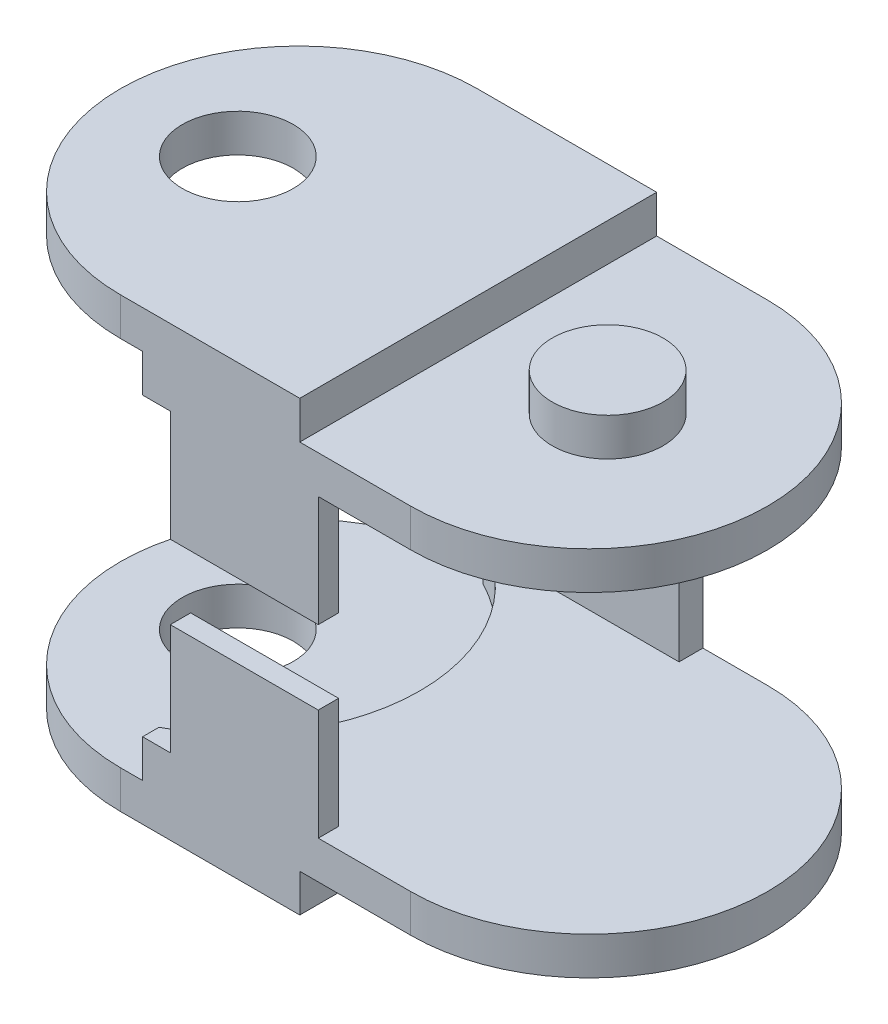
ISO-10303-21;
HEADER;
FILE_DESCRIPTION(('STEP AP214'),'2;1');
FILE_NAME('part.step','',(''),(''),'','','');
FILE_SCHEMA(('AUTOMOTIVE_DESIGN { 1 0 10303 214 1 1 1 1 }'));
ENDSEC;
DATA;
#1=APPLICATION_CONTEXT('core data for automotive mechanical design processes');
#2=APPLICATION_PROTOCOL_DEFINITION('international standard','automotive_design',2000,#1);
#3=PRODUCT_CONTEXT('',#1,'mechanical');
#4=PRODUCT('Part','Part','',(#3));
#5=PRODUCT_RELATED_PRODUCT_CATEGORY('part','',(#4));
#6=PRODUCT_DEFINITION_FORMATION('','',#4);
#7=PRODUCT_DEFINITION_CONTEXT('part definition',#1,'design');
#8=PRODUCT_DEFINITION('design','',#6,#7);
#9=PRODUCT_DEFINITION_SHAPE('','',#8);
#10=(LENGTH_UNIT() NAMED_UNIT(*) SI_UNIT(.MILLI.,.METRE.));
#11=(NAMED_UNIT(*) PLANE_ANGLE_UNIT() SI_UNIT($,.RADIAN.));
#12=(NAMED_UNIT(*) SI_UNIT($,.STERADIAN.) SOLID_ANGLE_UNIT());
#13=UNCERTAINTY_MEASURE_WITH_UNIT(LENGTH_MEASURE(1.E-05),#10,'distance_accuracy_value','');
#14=(GEOMETRIC_REPRESENTATION_CONTEXT(3) GLOBAL_UNCERTAINTY_ASSIGNED_CONTEXT((#13)) GLOBAL_UNIT_ASSIGNED_CONTEXT((#10,
#11,#12)) REPRESENTATION_CONTEXT('',''));
#15=CARTESIAN_POINT('',(0.,0.,0.));
#16=DIRECTION('',(0.,0.,1.));
#17=DIRECTION('',(1.,0.,0.));
#18=AXIS2_PLACEMENT_3D('',#15,#16,#17);
#19=CARTESIAN_POINT('',(-503.000001,20.1,56.));
#20=DIRECTION('',(0.,1.,0.));
#21=DIRECTION('',(0.,0.,1.));
#22=AXIS2_PLACEMENT_3D('',#19,#20,#21);
#23=PLANE('',#22);
#24=CARTESIAN_POINT('',(-503.000001,20.1,56.));
#25=DIRECTION('',(0.,-1.,0.));
#26=DIRECTION('',(0.,0.,-1.));
#27=AXIS2_PLACEMENT_3D('',#24,#25,#26);
#28=CIRCLE('',#27,3.);
#29=CARTESIAN_POINT('',(-503.000001,20.1,53.));
#30=VERTEX_POINT('',#29);
#31=EDGE_CURVE('E381',#30,#30,#28,.T.);
#32=ORIENTED_EDGE('',*,*,#31,.F.);
#33=EDGE_LOOP('',(#32));
#34=FACE_BOUND('',#33,.T.);
#35=ADVANCED_FACE('F17',(#34),#23,.T.);
#36=CARTESIAN_POINT('',(-518.500001,8.,56.));
#37=DIRECTION('',(-1.,0.,0.));
#38=DIRECTION('',(0.,0.,1.));
#39=AXIS2_PLACEMENT_3D('',#36,#37,#38);
#40=PLANE('',#39);
#41=DIRECTION('',(0.,1.,0.));
#42=VECTOR('',#41,1.);
#43=CARTESIAN_POINT('',(-518.500001,20.1,65.65));
#44=LINE('',#43,#42);
#45=CARTESIAN_POINT('',(-518.500001,18.05,65.65));
#46=VERTEX_POINT('',#45);
#47=CARTESIAN_POINT('',(-518.500001,16.,65.65));
#48=VERTEX_POINT('',#47);
#49=EDGE_CURVE('E390',#46,#48,#44,.F.);
#50=ORIENTED_EDGE('',*,*,#49,.F.);
#51=DIRECTION('',(0.,0.,-1.));
#52=VECTOR('',#51,1.);
#53=CARTESIAN_POINT('',(-518.500001,18.05,56.));
#54=LINE('',#53,#52);
#55=CARTESIAN_POINT('',(-518.500001,18.05,64.7619917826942));
#56=VERTEX_POINT('',#55);
#57=EDGE_CURVE('E393',#56,#46,#54,.F.);
#58=ORIENTED_EDGE('',*,*,#57,.F.);
#59=DIRECTION('',(0.,-1.,0.));
#60=VECTOR('',#59,1.);
#61=CARTESIAN_POINT('',(-518.500001,17.025,64.7619917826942));
#62=LINE('',#61,#60);
#63=CARTESIAN_POINT('',(-518.500001,16.,64.7619917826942));
#64=VERTEX_POINT('',#63);
#65=EDGE_CURVE('E378',#56,#64,#62,.T.);
#66=ORIENTED_EDGE('',*,*,#65,.T.);
#67=DIRECTION('',(0.,0.,1.));
#68=VECTOR('',#67,1.);
#69=CARTESIAN_POINT('',(-518.500001,16.,56.));
#70=LINE('',#69,#68);
#71=EDGE_CURVE('E236',#64,#48,#70,.T.);
#72=ORIENTED_EDGE('',*,*,#71,.T.);
#73=EDGE_LOOP('',(#50,#58,#66,#72));
#74=FACE_BOUND('',#73,.T.);
#75=ADVANCED_FACE('F798',(#74),#40,.T.);
#76=CARTESIAN_POINT('',(-509.000001,8.,65.1));
#77=DIRECTION('',(-1.,0.,0.));
#78=DIRECTION('',(0.,0.,1.));
#79=AXIS2_PLACEMENT_3D('',#76,#77,#78);
#80=PLANE('',#79);
#81=DIRECTION('',(0.,1.,0.));
#82=VECTOR('',#81,1.);
#83=CARTESIAN_POINT('',(-509.000001,8.,64.55));
#84=LINE('',#83,#82);
#85=CARTESIAN_POINT('',(-509.000001,10.,64.55));
#86=VERTEX_POINT('',#85);
#87=CARTESIAN_POINT('',(-509.000001,16.,64.55));
#88=VERTEX_POINT('',#87);
#89=EDGE_CURVE('E230',#86,#88,#84,.T.);
#90=ORIENTED_EDGE('',*,*,#89,.T.);
#91=DIRECTION('',(0.,0.,1.));
#92=VECTOR('',#91,1.);
#93=CARTESIAN_POINT('',(-509.000001,16.,65.1));
#94=LINE('',#93,#92);
#95=CARTESIAN_POINT('',(-509.000001,16.,65.65));
#96=VERTEX_POINT('',#95);
#97=EDGE_CURVE('E225',#96,#88,#94,.F.);
#98=ORIENTED_EDGE('',*,*,#97,.F.);
#99=DIRECTION('',(0.,1.,0.));
#100=VECTOR('',#99,1.);
#101=CARTESIAN_POINT('',(-509.000001,20.1,65.65));
#102=LINE('',#101,#100);
#103=CARTESIAN_POINT('',(-509.000001,10.,65.65));
#104=VERTEX_POINT('',#103);
#105=EDGE_CURVE('E229',#104,#96,#102,.T.);
#106=ORIENTED_EDGE('',*,*,#105,.F.);
#107=DIRECTION('',(0.,0.,-1.));
#108=VECTOR('',#107,1.);
#109=CARTESIAN_POINT('',(-509.000001,10.,65.1));
#110=LINE('',#109,#108);
#111=EDGE_CURVE('E407',#86,#104,#110,.F.);
#112=ORIENTED_EDGE('',*,*,#111,.F.);
#113=EDGE_LOOP('',(#90,#98,#106,#112));
#114=FACE_BOUND('',#113,.T.);
#115=ADVANCED_FACE('F227',(#114),#80,.F.);
#116=CARTESIAN_POINT('',(-517.000001,8.,65.1));
#117=DIRECTION('',(1.,0.,0.));
#118=DIRECTION('',(0.,0.,-1.));
#119=AXIS2_PLACEMENT_3D('',#116,#117,#118);
#120=PLANE('',#119);
#121=DIRECTION('',(0.,1.,0.));
#122=VECTOR('',#121,1.);
#123=CARTESIAN_POINT('',(-517.000001,20.1,65.65));
#124=LINE('',#123,#122);
#125=CARTESIAN_POINT('',(-517.000001,16.,65.65));
#126=VERTEX_POINT('',#125);
#127=CARTESIAN_POINT('',(-517.000001,10.,65.65));
#128=VERTEX_POINT('',#127);
#129=EDGE_CURVE('E424',#126,#128,#124,.F.);
#130=ORIENTED_EDGE('',*,*,#129,.F.);
#131=DIRECTION('',(0.,0.,-1.));
#132=VECTOR('',#131,1.);
#133=CARTESIAN_POINT('',(-517.000001,16.,65.1));
#134=LINE('',#133,#132);
#135=CARTESIAN_POINT('',(-517.000001,16.,64.55));
#136=VERTEX_POINT('',#135);
#137=EDGE_CURVE('E235',#136,#126,#134,.F.);
#138=ORIENTED_EDGE('',*,*,#137,.F.);
#139=DIRECTION('',(0.,1.,0.));
#140=VECTOR('',#139,1.);
#141=CARTESIAN_POINT('',(-517.000001,8.,64.55));
#142=LINE('',#141,#140);
#143=CARTESIAN_POINT('',(-517.000001,10.,64.55));
#144=VERTEX_POINT('',#143);
#145=EDGE_CURVE('E436',#136,#144,#142,.F.);
#146=ORIENTED_EDGE('',*,*,#145,.T.);
#147=DIRECTION('',(0.,0.,-1.));
#148=VECTOR('',#147,1.);
#149=CARTESIAN_POINT('',(-517.000001,10.,65.1));
#150=LINE('',#149,#148);
#151=EDGE_CURVE('E402',#128,#144,#150,.T.);
#152=ORIENTED_EDGE('',*,*,#151,.F.);
#153=EDGE_LOOP('',(#130,#138,#146,#152));
#154=FACE_BOUND('',#153,.T.);
#155=ADVANCED_FACE('F792',(#154),#120,.F.);
#156=CARTESIAN_POINT('',(-513.000001,10.,65.1));
#157=DIRECTION('',(0.,-1.,0.));
#158=DIRECTION('',(0.,0.,-1.));
#159=AXIS2_PLACEMENT_3D('',#156,#157,#158);
#160=PLANE('',#159);
#161=ORIENTED_EDGE('',*,*,#151,.T.);
#162=DIRECTION('',(1.,0.,0.));
#163=VECTOR('',#162,1.);
#164=CARTESIAN_POINT('',(-513.000001,10.,64.55));
#165=LINE('',#164,#163);
#166=EDGE_CURVE('E432',#144,#86,#165,.T.);
#167=ORIENTED_EDGE('',*,*,#166,.T.);
#168=ORIENTED_EDGE('',*,*,#111,.T.);
#169=DIRECTION('',(1.,0.,0.));
#170=VECTOR('',#169,1.);
#171=CARTESIAN_POINT('',(-511.850001,10.,65.65));
#172=LINE('',#171,#170);
#173=EDGE_CURVE('E246',#128,#104,#172,.T.);
#174=ORIENTED_EDGE('',*,*,#173,.F.);
#175=EDGE_LOOP('',(#161,#167,#168,#174));
#176=FACE_BOUND('',#175,.T.);
#177=ADVANCED_FACE('F788',(#176),#160,.T.);
#178=CARTESIAN_POINT('',(-503.000001,-4.1,56.));
#179=DIRECTION('',(0.,-1.,0.));
#180=DIRECTION('',(0.,0.,-1.));
#181=AXIS2_PLACEMENT_3D('',#178,#179,#180);
#182=PLANE('',#181);
#183=CARTESIAN_POINT('',(-503.000001,-4.1,56.));
#184=DIRECTION('',(0.,-1.,0.));
#185=DIRECTION('',(0.,0.,-1.));
#186=AXIS2_PLACEMENT_3D('',#183,#184,#185);
#187=CIRCLE('',#186,3.);
#188=CARTESIAN_POINT('',(-503.000001,-4.1,53.));
#189=VERTEX_POINT('',#188);
#190=EDGE_CURVE('E435',#189,#189,#187,.F.);
#191=ORIENTED_EDGE('',*,*,#190,.F.);
#192=EDGE_LOOP('',(#191));
#193=FACE_BOUND('',#192,.T.);
#194=ADVANCED_FACE('F785',(#193),#182,.T.);
#195=CARTESIAN_POINT('',(-528.500001,18.05,56.));
#196=DIRECTION('',(0.,-1.,0.));
#197=DIRECTION('',(0.,0.,-1.));
#198=AXIS2_PLACEMENT_3D('',#195,#196,#197);
#199=PLANE('',#198);
#200=CARTESIAN_POINT('',(-523.000001,18.05,56.));
#201=DIRECTION('',(0.,-1.,0.));
#202=DIRECTION('',(0.,0.,-1.));
#203=AXIS2_PLACEMENT_3D('',#200,#201,#202);
#204=CIRCLE('',#203,3.);
#205=CARTESIAN_POINT('',(-523.000001,18.05,53.));
#206=VERTEX_POINT('',#205);
#207=EDGE_CURVE('E20',#206,#206,#204,.F.);
#208=ORIENTED_EDGE('',*,*,#207,.T.);
#209=EDGE_LOOP('',(#208));
#210=FACE_BOUND('',#209,.T.);
#211=ORIENTED_EDGE('',*,*,#57,.T.);
#212=DIRECTION('',(1.,0.,0.));
#213=VECTOR('',#212,1.);
#214=CARTESIAN_POINT('',(-511.850001,18.05,65.65));
#215=LINE('',#214,#213);
#216=CARTESIAN_POINT('',(-519.700001,18.05,65.65));
#217=VERTEX_POINT('',#216);
#218=EDGE_CURVE('E247',#217,#46,#215,.T.);
#219=ORIENTED_EDGE('',*,*,#218,.F.);
#220=CARTESIAN_POINT('',(-519.700001,18.05,56.));
#221=DIRECTION('',(0.,-1.,0.));
#222=DIRECTION('',(0.,0.,-1.));
#223=AXIS2_PLACEMENT_3D('',#220,#221,#222);
#224=CIRCLE('',#223,9.65);
#225=CARTESIAN_POINT('',(-519.700001,18.05,46.35));
#226=VERTEX_POINT('',#225);
#227=EDGE_CURVE('E387',#226,#217,#224,.F.);
#228=ORIENTED_EDGE('',*,*,#227,.F.);
#229=DIRECTION('',(1.,0.,0.));
#230=VECTOR('',#229,1.);
#231=CARTESIAN_POINT('',(-528.500001,18.05,46.35));
#232=LINE('',#231,#230);
#233=CARTESIAN_POINT('',(-518.500001,18.05,46.35));
#234=VERTEX_POINT('',#233);
#235=EDGE_CURVE('E398',#226,#234,#232,.T.);
#236=ORIENTED_EDGE('',*,*,#235,.T.);
#237=DIRECTION('',(0.,0.,-1.));
#238=VECTOR('',#237,1.);
#239=CARTESIAN_POINT('',(-518.500001,18.05,56.));
#240=LINE('',#239,#238);
#241=CARTESIAN_POINT('',(-518.500001,18.05,47.2380082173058));
#242=VERTEX_POINT('',#241);
#243=EDGE_CURVE('E139',#234,#242,#240,.F.);
#244=ORIENTED_EDGE('',*,*,#243,.T.);
#245=CARTESIAN_POINT('',(-523.000001,18.05,56.));
#246=DIRECTION('',(0.,-1.,0.));
#247=DIRECTION('',(0.,0.,-1.));
#248=AXIS2_PLACEMENT_3D('',#245,#246,#247);
#249=CIRCLE('',#248,9.85000000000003);
#250=EDGE_CURVE('E498',#242,#56,#249,.T.);
#251=ORIENTED_EDGE('',*,*,#250,.T.);
#252=EDGE_LOOP('',(#211,#219,#228,#236,#244,#251));
#253=FACE_BOUND('',#252,.T.);
#254=ADVANCED_FACE('F507',(#210,#253),#199,.T.);
#255=CARTESIAN_POINT('',(-523.000001,19.075,56.));
#256=DIRECTION('',(0.,-1.,0.));
#257=DIRECTION('',(0.,0.,-1.));
#258=AXIS2_PLACEMENT_3D('',#255,#256,#257);
#259=CYLINDRICAL_SURFACE('',#258,3.);
#260=ORIENTED_EDGE('',*,*,#207,.F.);
#261=EDGE_LOOP('',(#260));
#262=FACE_BOUND('',#261,.T.);
#263=CARTESIAN_POINT('',(-523.000001,20.1,56.));
#264=DIRECTION('',(0.,-1.,0.));
#265=DIRECTION('',(0.,0.,-1.));
#266=AXIS2_PLACEMENT_3D('',#263,#264,#265);
#267=CIRCLE('',#266,3.);
#268=CARTESIAN_POINT('',(-523.000001,20.1,53.));
#269=VERTEX_POINT('',#268);
#270=EDGE_CURVE('E383',#269,#269,#267,.F.);
#271=ORIENTED_EDGE('',*,*,#270,.T.);
#272=EDGE_LOOP('',(#271));
#273=FACE_BOUND('',#272,.T.);
#274=ADVANCED_FACE('F509',(#262,#273),#259,.F.);
#275=CARTESIAN_POINT('',(-503.000001,19.075,56.));
#276=DIRECTION('',(0.,-1.,0.));
#277=DIRECTION('',(0.,0.,-1.));
#278=AXIS2_PLACEMENT_3D('',#275,#276,#277);
#279=CYLINDRICAL_SURFACE('',#278,3.);
#280=ORIENTED_EDGE('',*,*,#31,.T.);
#281=EDGE_LOOP('',(#280));
#282=FACE_BOUND('',#281,.T.);
#283=CARTESIAN_POINT('',(-503.000001,18.05,56.));
#284=DIRECTION('',(0.,-1.,0.));
#285=DIRECTION('',(0.,0.,-1.));
#286=AXIS2_PLACEMENT_3D('',#283,#284,#285);
#287=CIRCLE('',#286,3.);
#288=CARTESIAN_POINT('',(-503.000001,18.05,53.));
#289=VERTEX_POINT('',#288);
#290=EDGE_CURVE('E284',#289,#289,#287,.F.);
#291=ORIENTED_EDGE('',*,*,#290,.T.);
#292=EDGE_LOOP('',(#291));
#293=FACE_BOUND('',#292,.T.);
#294=ADVANCED_FACE('F512',(#282,#293),#279,.T.);
#295=CARTESIAN_POINT('',(-511.850001,20.1,65.65));
#296=DIRECTION('',(0.,0.,1.));
#297=DIRECTION('',(1.,0.,0.));
#298=AXIS2_PLACEMENT_3D('',#295,#296,#297);
#299=PLANE('',#298);
#300=DIRECTION('',(1.,0.,0.));
#301=VECTOR('',#300,1.);
#302=CARTESIAN_POINT('',(-511.850001,16.,65.65));
#303=LINE('',#302,#301);
#304=EDGE_CURVE('E410',#48,#126,#303,.T.);
#305=ORIENTED_EDGE('',*,*,#304,.T.);
#306=ORIENTED_EDGE('',*,*,#129,.T.);
#307=ORIENTED_EDGE('',*,*,#173,.T.);
#308=ORIENTED_EDGE('',*,*,#105,.T.);
#309=DIRECTION('',(1.,0.,0.));
#310=VECTOR('',#309,1.);
#311=CARTESIAN_POINT('',(-513.000001,16.,65.65));
#312=LINE('',#311,#310);
#313=CARTESIAN_POINT('',(-504.000001,16.,65.65));
#314=VERTEX_POINT('',#313);
#315=EDGE_CURVE('E243',#314,#96,#312,.F.);
#316=ORIENTED_EDGE('',*,*,#315,.F.);
#317=DIRECTION('',(0.,-1.,0.));
#318=VECTOR('',#317,1.);
#319=CARTESIAN_POINT('',(-504.000001,20.1,65.65));
#320=LINE('',#319,#318);
#321=CARTESIAN_POINT('',(-504.000001,18.05,65.65));
#322=VERTEX_POINT('',#321);
#323=EDGE_CURVE('E375',#322,#314,#320,.T.);
#324=ORIENTED_EDGE('',*,*,#323,.F.);
#325=DIRECTION('',(1.,0.,0.));
#326=VECTOR('',#325,1.);
#327=CARTESIAN_POINT('',(-501.675001,18.05,65.65));
#328=LINE('',#327,#326);
#329=CARTESIAN_POINT('',(-510.000001,18.05,65.65));
#330=VERTEX_POINT('',#329);
#331=EDGE_CURVE('E275',#322,#330,#328,.F.);
#332=ORIENTED_EDGE('',*,*,#331,.T.);
#333=DIRECTION('',(0.,1.,0.));
#334=VECTOR('',#333,1.);
#335=CARTESIAN_POINT('',(-510.000001,19.075,65.65));
#336=LINE('',#335,#334);
#337=CARTESIAN_POINT('',(-510.000001,20.1,65.65));
#338=VERTEX_POINT('',#337);
#339=EDGE_CURVE('E293',#338,#330,#336,.F.);
#340=ORIENTED_EDGE('',*,*,#339,.F.);
#341=DIRECTION('',(1.,0.,0.));
#342=VECTOR('',#341,1.);
#343=CARTESIAN_POINT('',(-511.850001,20.1,65.65));
#344=LINE('',#343,#342);
#345=CARTESIAN_POINT('',(-519.700001,20.1,65.65));
#346=VERTEX_POINT('',#345);
#347=EDGE_CURVE('E300',#338,#346,#344,.F.);
#348=ORIENTED_EDGE('',*,*,#347,.T.);
#349=DIRECTION('',(0.,-1.,0.));
#350=VECTOR('',#349,1.);
#351=CARTESIAN_POINT('',(-519.700001,20.1,65.65));
#352=LINE('',#351,#350);
#353=EDGE_CURVE('E304',#217,#346,#352,.F.);
#354=ORIENTED_EDGE('',*,*,#353,.F.);
#355=ORIENTED_EDGE('',*,*,#218,.T.);
#356=ORIENTED_EDGE('',*,*,#49,.T.);
#357=EDGE_LOOP('',(#305,#306,#307,#308,#316,#324,#332,#340,#348,#354,#355,#356));
#358=FACE_BOUND('',#357,.T.);
#359=ADVANCED_FACE('F241',(#358),#299,.T.);
#360=CARTESIAN_POINT('',(-513.000001,8.,64.55));
#361=DIRECTION('',(0.,0.,1.));
#362=DIRECTION('',(1.,0.,0.));
#363=AXIS2_PLACEMENT_3D('',#360,#361,#362);
#364=PLANE('',#363);
#365=ORIENTED_EDGE('',*,*,#145,.F.);
#366=DIRECTION('',(1.,0.,0.));
#367=VECTOR('',#366,1.);
#368=CARTESIAN_POINT('',(-513.000001,16.,64.55));
#369=LINE('',#368,#367);
#370=EDGE_CURVE('E255',#88,#136,#369,.F.);
#371=ORIENTED_EDGE('',*,*,#370,.F.);
#372=ORIENTED_EDGE('',*,*,#89,.F.);
#373=ORIENTED_EDGE('',*,*,#166,.F.);
#374=EDGE_LOOP('',(#365,#371,#372,#373));
#375=FACE_BOUND('',#374,.T.);
#376=ADVANCED_FACE('F770',(#375),#364,.F.);
#377=CARTESIAN_POINT('',(-503.000001,-3.075,56.));
#378=DIRECTION('',(0.,-1.,0.));
#379=DIRECTION('',(0.,0.,-1.));
#380=AXIS2_PLACEMENT_3D('',#377,#378,#379);
#381=CYLINDRICAL_SURFACE('',#380,3.);
#382=CARTESIAN_POINT('',(-503.000001,-2.05,56.));
#383=DIRECTION('',(0.,-1.,0.));
#384=DIRECTION('',(0.,0.,-1.));
#385=AXIS2_PLACEMENT_3D('',#382,#383,#384);
#386=CIRCLE('',#385,3.);
#387=CARTESIAN_POINT('',(-503.000001,-2.05,53.));
#388=VERTEX_POINT('',#387);
#389=EDGE_CURVE('E473',#388,#388,#386,.F.);
#390=ORIENTED_EDGE('',*,*,#389,.F.);
#391=EDGE_LOOP('',(#390));
#392=FACE_BOUND('',#391,.T.);
#393=ORIENTED_EDGE('',*,*,#190,.T.);
#394=EDGE_LOOP('',(#393));
#395=FACE_BOUND('',#394,.T.);
#396=ADVANCED_FACE('F760',(#392,#395),#381,.T.);
#397=CARTESIAN_POINT('',(-523.000001,-3.075,56.));
#398=DIRECTION('',(0.,-1.,0.));
#399=DIRECTION('',(0.,0.,-1.));
#400=AXIS2_PLACEMENT_3D('',#397,#398,#399);
#401=CYLINDRICAL_SURFACE('',#400,3.);
#402=CARTESIAN_POINT('',(-523.000001,-4.1,56.));
#403=DIRECTION('',(0.,-1.,0.));
#404=DIRECTION('',(0.,0.,-1.));
#405=AXIS2_PLACEMENT_3D('',#402,#403,#404);
#406=CIRCLE('',#405,3.);
#407=CARTESIAN_POINT('',(-523.000001,-4.1,53.));
#408=VERTEX_POINT('',#407);
#409=EDGE_CURVE('E478',#408,#408,#406,.F.);
#410=ORIENTED_EDGE('',*,*,#409,.F.);
#411=EDGE_LOOP('',(#410));
#412=FACE_BOUND('',#411,.T.);
#413=CARTESIAN_POINT('',(-523.000001,-2.05,56.));
#414=DIRECTION('',(0.,-1.,0.));
#415=DIRECTION('',(0.,0.,-1.));
#416=AXIS2_PLACEMENT_3D('',#413,#414,#415);
#417=CIRCLE('',#416,3.);
#418=CARTESIAN_POINT('',(-523.000001,-2.05,53.));
#419=VERTEX_POINT('',#418);
#420=EDGE_CURVE('E345',#419,#419,#417,.F.);
#421=ORIENTED_EDGE('',*,*,#420,.T.);
#422=EDGE_LOOP('',(#421));
#423=FACE_BOUND('',#422,.T.);
#424=ADVANCED_FACE('F757',(#412,#423),#401,.F.);
#425=CARTESIAN_POINT('',(-523.000001,17.025,56.));
#426=DIRECTION('',(0.,-1.,0.));
#427=DIRECTION('',(0.,0.,-1.));
#428=AXIS2_PLACEMENT_3D('',#425,#426,#427);
#429=CYLINDRICAL_SURFACE('',#428,9.85000000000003);
#430=ORIENTED_EDGE('',*,*,#250,.F.);
#431=DIRECTION('',(0.,1.,0.));
#432=VECTOR('',#431,1.);
#433=CARTESIAN_POINT('',(-518.500001,8.,47.2380082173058));
#434=LINE('',#433,#432);
#435=CARTESIAN_POINT('',(-518.500001,16.,47.2380082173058));
#436=VERTEX_POINT('',#435);
#437=EDGE_CURVE('E344',#436,#242,#434,.T.);
#438=ORIENTED_EDGE('',*,*,#437,.F.);
#439=CARTESIAN_POINT('',(-523.000001,16.,56.));
#440=DIRECTION('',(0.,-1.,0.));
#441=DIRECTION('',(0.,0.,-1.));
#442=AXIS2_PLACEMENT_3D('',#439,#440,#441);
#443=CIRCLE('',#442,9.85000000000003);
#444=CARTESIAN_POINT('',(-517.790113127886,16.,47.6406));
#445=VERTEX_POINT('',#444);
#446=EDGE_CURVE('E495',#436,#445,#443,.T.);
#447=ORIENTED_EDGE('',*,*,#446,.T.);
#448=CARTESIAN_POINT('',(-523.000001,16.,56.));
#449=DIRECTION('',(0.,-1.,0.));
#450=DIRECTION('',(0.,0.,-1.));
#451=AXIS2_PLACEMENT_3D('',#448,#449,#450);
#452=CIRCLE('',#451,9.85000000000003);
#453=EDGE_CURVE('E259',#64,#445,#452,.F.);
#454=ORIENTED_EDGE('',*,*,#453,.F.);
#455=ORIENTED_EDGE('',*,*,#65,.F.);
#456=EDGE_LOOP('',(#430,#438,#447,#454,#455));
#457=FACE_BOUND('',#456,.T.);
#458=ADVANCED_FACE('F759',(#457),#429,.F.);
#459=CARTESIAN_POINT('',(-523.000001,16.,56.));
#460=DIRECTION('',(0.,-1.,0.));
#461=DIRECTION('',(0.,0.,-1.));
#462=AXIS2_PLACEMENT_3D('',#459,#460,#461);
#463=PLANE('',#462);
#464=ORIENTED_EDGE('',*,*,#446,.F.);
#465=DIRECTION('',(0.,0.,1.));
#466=VECTOR('',#465,1.);
#467=CARTESIAN_POINT('',(-518.500001,16.,56.));
#468=LINE('',#467,#466);
#469=CARTESIAN_POINT('',(-518.500001,16.,47.6406));
#470=VERTEX_POINT('',#469);
#471=EDGE_CURVE('E341',#470,#436,#468,.F.);
#472=ORIENTED_EDGE('',*,*,#471,.F.);
#473=DIRECTION('',(-1.,0.,0.));
#474=VECTOR('',#473,1.);
#475=CARTESIAN_POINT('',(-513.000001,16.,47.6406));
#476=LINE('',#475,#474);
#477=EDGE_CURVE('E329',#470,#445,#476,.F.);
#478=ORIENTED_EDGE('',*,*,#477,.T.);
#479=EDGE_LOOP('',(#464,#472,#478));
#480=FACE_BOUND('',#479,.T.);
#481=ADVANCED_FACE('F767',(#480),#463,.F.);
#482=CARTESIAN_POINT('',(-519.700001,20.1,56.));
#483=DIRECTION('',(0.,-1.,0.));
#484=DIRECTION('',(0.,0.,-1.));
#485=AXIS2_PLACEMENT_3D('',#482,#483,#484);
#486=CYLINDRICAL_SURFACE('',#485,9.65);
#487=CARTESIAN_POINT('',(-519.700001,20.1,56.));
#488=DIRECTION('',(0.,-1.,0.));
#489=DIRECTION('',(0.,0.,-1.));
#490=AXIS2_PLACEMENT_3D('',#487,#488,#489);
#491=CIRCLE('',#490,9.65);
#492=CARTESIAN_POINT('',(-519.700001,20.1,46.35));
#493=VERTEX_POINT('',#492);
#494=EDGE_CURVE('E303',#346,#493,#491,.T.);
#495=ORIENTED_EDGE('',*,*,#494,.T.);
#496=DIRECTION('',(0.,1.,0.));
#497=VECTOR('',#496,1.);
#498=CARTESIAN_POINT('',(-519.700001,20.1,46.35));
#499=LINE('',#498,#497);
#500=EDGE_CURVE('E297',#226,#493,#499,.T.);
#501=ORIENTED_EDGE('',*,*,#500,.F.);
#502=ORIENTED_EDGE('',*,*,#227,.T.);
#503=ORIENTED_EDGE('',*,*,#353,.T.);
#504=EDGE_LOOP('',(#495,#501,#502,#503));
#505=FACE_BOUND('',#504,.T.);
#506=ADVANCED_FACE('F520',(#505),#486,.T.);
#507=CARTESIAN_POINT('',(-511.850001,20.1,56.));
#508=DIRECTION('',(0.,-1.,0.));
#509=DIRECTION('',(0.,0.,-1.));
#510=AXIS2_PLACEMENT_3D('',#507,#508,#509);
#511=PLANE('',#510);
#512=ORIENTED_EDGE('',*,*,#270,.F.);
#513=EDGE_LOOP('',(#512));
#514=FACE_BOUND('',#513,.T.);
#515=DIRECTION('',(-1.,0.,0.));
#516=VECTOR('',#515,1.);
#517=CARTESIAN_POINT('',(-511.850001,20.1,46.35));
#518=LINE('',#517,#516);
#519=CARTESIAN_POINT('',(-510.000001,20.1,46.35));
#520=VERTEX_POINT('',#519);
#521=EDGE_CURVE('E288',#493,#520,#518,.F.);
#522=ORIENTED_EDGE('',*,*,#521,.F.);
#523=ORIENTED_EDGE('',*,*,#494,.F.);
#524=ORIENTED_EDGE('',*,*,#347,.F.);
#525=DIRECTION('',(0.,0.,-1.));
#526=VECTOR('',#525,1.);
#527=CARTESIAN_POINT('',(-510.000001,20.1,56.));
#528=LINE('',#527,#526);
#529=EDGE_CURVE('E279',#520,#338,#528,.F.);
#530=ORIENTED_EDGE('',*,*,#529,.F.);
#531=EDGE_LOOP('',(#522,#523,#524,#530));
#532=FACE_BOUND('',#531,.T.);
#533=ADVANCED_FACE('F516',(#514,#532),#511,.F.);
#534=CARTESIAN_POINT('',(-510.000001,19.075,56.));
#535=DIRECTION('',(1.,0.,0.));
#536=DIRECTION('',(0.,0.,-1.));
#537=AXIS2_PLACEMENT_3D('',#534,#535,#536);
#538=PLANE('',#537);
#539=DIRECTION('',(0.,1.,0.));
#540=VECTOR('',#539,1.);
#541=CARTESIAN_POINT('',(-510.000001,20.1,46.35));
#542=LINE('',#541,#540);
#543=CARTESIAN_POINT('',(-510.000001,18.05,46.35));
#544=VERTEX_POINT('',#543);
#545=EDGE_CURVE('E272',#520,#544,#542,.F.);
#546=ORIENTED_EDGE('',*,*,#545,.F.);
#547=ORIENTED_EDGE('',*,*,#529,.T.);
#548=ORIENTED_EDGE('',*,*,#339,.T.);
#549=DIRECTION('',(0.,0.,-1.));
#550=VECTOR('',#549,1.);
#551=CARTESIAN_POINT('',(-510.000001,18.05,56.));
#552=LINE('',#551,#550);
#553=EDGE_CURVE('E278',#330,#544,#552,.T.);
#554=ORIENTED_EDGE('',*,*,#553,.T.);
#555=EDGE_LOOP('',(#546,#547,#548,#554));
#556=FACE_BOUND('',#555,.T.);
#557=ADVANCED_FACE('F519',(#556),#538,.T.);
#558=CARTESIAN_POINT('',(-501.675001,18.05,56.));
#559=DIRECTION('',(0.,-1.,0.));
#560=DIRECTION('',(0.,0.,-1.));
#561=AXIS2_PLACEMENT_3D('',#558,#559,#560);
#562=PLANE('',#561);
#563=ORIENTED_EDGE('',*,*,#290,.F.);
#564=EDGE_LOOP('',(#563));
#565=FACE_BOUND('',#564,.T.);
#566=DIRECTION('',(-1.,0.,0.));
#567=VECTOR('',#566,1.);
#568=CARTESIAN_POINT('',(-511.850001,18.05,46.35));
#569=LINE('',#568,#567);
#570=CARTESIAN_POINT('',(-504.000001,18.05,46.35));
#571=VERTEX_POINT('',#570);
#572=EDGE_CURVE('E270',#544,#571,#569,.F.);
#573=ORIENTED_EDGE('',*,*,#572,.F.);
#574=ORIENTED_EDGE('',*,*,#553,.F.);
#575=ORIENTED_EDGE('',*,*,#331,.F.);
#576=CARTESIAN_POINT('',(-504.000001,18.05,56.));
#577=DIRECTION('',(0.,-1.,0.));
#578=DIRECTION('',(0.,0.,-1.));
#579=AXIS2_PLACEMENT_3D('',#576,#577,#578);
#580=CIRCLE('',#579,9.65);
#581=EDGE_CURVE('E377',#571,#322,#580,.T.);
#582=ORIENTED_EDGE('',*,*,#581,.F.);
#583=EDGE_LOOP('',(#573,#574,#575,#582));
#584=FACE_BOUND('',#583,.T.);
#585=ADVANCED_FACE('F541',(#565,#584),#562,.F.);
#586=CARTESIAN_POINT('',(-504.000001,20.1,56.));
#587=DIRECTION('',(0.,-1.,0.));
#588=DIRECTION('',(0.,0.,-1.));
#589=AXIS2_PLACEMENT_3D('',#586,#587,#588);
#590=CYLINDRICAL_SURFACE('',#589,9.65);
#591=CARTESIAN_POINT('',(-504.000001,16.,56.));
#592=DIRECTION('',(0.,-1.,0.));
#593=DIRECTION('',(0.,0.,-1.));
#594=AXIS2_PLACEMENT_3D('',#591,#592,#593);
#595=CIRCLE('',#594,9.65);
#596=CARTESIAN_POINT('',(-504.000001,16.,46.35));
#597=VERTEX_POINT('',#596);
#598=EDGE_CURVE('E254',#597,#314,#595,.T.);
#599=ORIENTED_EDGE('',*,*,#598,.F.);
#600=DIRECTION('',(0.,1.,0.));
#601=VECTOR('',#600,1.);
#602=CARTESIAN_POINT('',(-504.000001,20.1,46.35));
#603=LINE('',#602,#601);
#604=EDGE_CURVE('E267',#571,#597,#603,.F.);
#605=ORIENTED_EDGE('',*,*,#604,.F.);
#606=ORIENTED_EDGE('',*,*,#581,.T.);
#607=ORIENTED_EDGE('',*,*,#323,.T.);
#608=EDGE_LOOP('',(#599,#605,#606,#607));
#609=FACE_BOUND('',#608,.T.);
#610=ADVANCED_FACE('F546',(#609),#590,.T.);
#611=CARTESIAN_POINT('',(-513.000001,16.,56.));
#612=DIRECTION('',(0.,-1.,0.));
#613=DIRECTION('',(0.,0.,-1.));
#614=AXIS2_PLACEMENT_3D('',#611,#612,#613);
#615=PLANE('',#614);
#616=ORIENTED_EDGE('',*,*,#304,.F.);
#617=ORIENTED_EDGE('',*,*,#71,.F.);
#618=ORIENTED_EDGE('',*,*,#453,.T.);
#619=DIRECTION('',(-1.,0.,0.));
#620=VECTOR('',#619,1.);
#621=CARTESIAN_POINT('',(-513.000001,16.,47.6406));
#622=LINE('',#621,#620);
#623=CARTESIAN_POINT('',(-507.500001,16.,47.6406));
#624=VERTEX_POINT('',#623);
#625=EDGE_CURVE('E325',#445,#624,#622,.F.);
#626=ORIENTED_EDGE('',*,*,#625,.T.);
#627=DIRECTION('',(0.,0.,1.));
#628=VECTOR('',#627,1.);
#629=CARTESIAN_POINT('',(-507.500001,16.,46.9953));
#630=LINE('',#629,#628);
#631=CARTESIAN_POINT('',(-507.500001,16.,46.35));
#632=VERTEX_POINT('',#631);
#633=EDGE_CURVE('E483',#624,#632,#630,.F.);
#634=ORIENTED_EDGE('',*,*,#633,.T.);
#635=DIRECTION('',(-1.,0.,0.));
#636=VECTOR('',#635,1.);
#637=CARTESIAN_POINT('',(-511.850001,16.,46.35));
#638=LINE('',#637,#636);
#639=EDGE_CURVE('E269',#597,#632,#638,.T.);
#640=ORIENTED_EDGE('',*,*,#639,.F.);
#641=ORIENTED_EDGE('',*,*,#598,.T.);
#642=ORIENTED_EDGE('',*,*,#315,.T.);
#643=ORIENTED_EDGE('',*,*,#97,.T.);
#644=ORIENTED_EDGE('',*,*,#370,.T.);
#645=ORIENTED_EDGE('',*,*,#137,.T.);
#646=EDGE_LOOP('',(#616,#617,#618,#626,#634,#640,#641,#642,#643,#644,#645));
#647=FACE_BOUND('',#646,.T.);
#648=ADVANCED_FACE('F251',(#647),#615,.T.);
#649=CARTESIAN_POINT('',(-507.500001,8.,46.9953));
#650=DIRECTION('',(-1.,0.,0.));
#651=DIRECTION('',(0.,0.,1.));
#652=AXIS2_PLACEMENT_3D('',#649,#650,#651);
#653=PLANE('',#652);
#654=ORIENTED_EDGE('',*,*,#633,.F.);
#655=DIRECTION('',(0.,1.,0.));
#656=VECTOR('',#655,1.);
#657=CARTESIAN_POINT('',(-507.500001,8.,47.6406));
#658=LINE('',#657,#656);
#659=CARTESIAN_POINT('',(-507.500001,0.,47.6406));
#660=VERTEX_POINT('',#659);
#661=EDGE_CURVE('E328',#624,#660,#658,.F.);
#662=ORIENTED_EDGE('',*,*,#661,.T.);
#663=DIRECTION('',(0.,0.,1.));
#664=VECTOR('',#663,1.);
#665=CARTESIAN_POINT('',(-507.500001,0.,46.9953));
#666=LINE('',#665,#664);
#667=CARTESIAN_POINT('',(-507.500001,0.,46.35));
#668=VERTEX_POINT('',#667);
#669=EDGE_CURVE('E257',#668,#660,#666,.T.);
#670=ORIENTED_EDGE('',*,*,#669,.F.);
#671=DIRECTION('',(0.,1.,0.));
#672=VECTOR('',#671,1.);
#673=CARTESIAN_POINT('',(-507.500001,20.1,46.35));
#674=LINE('',#673,#672);
#675=EDGE_CURVE('E548',#632,#668,#674,.F.);
#676=ORIENTED_EDGE('',*,*,#675,.F.);
#677=EDGE_LOOP('',(#654,#662,#670,#676));
#678=FACE_BOUND('',#677,.T.);
#679=ADVANCED_FACE('F687',(#678),#653,.F.);
#680=CARTESIAN_POINT('',(-519.700001,20.1,56.));
#681=DIRECTION('',(0.,-1.,0.));
#682=DIRECTION('',(0.,0.,-1.));
#683=AXIS2_PLACEMENT_3D('',#680,#681,#682);
#684=CYLINDRICAL_SURFACE('',#683,9.65);
#685=CARTESIAN_POINT('',(-519.700001,-4.1,56.));
#686=DIRECTION('',(0.,-1.,0.));
#687=DIRECTION('',(0.,0.,-1.));
#688=AXIS2_PLACEMENT_3D('',#685,#686,#687);
#689=CIRCLE('',#688,9.65);
#690=CARTESIAN_POINT('',(-519.700001,-4.1,65.65));
#691=VERTEX_POINT('',#690);
#692=CARTESIAN_POINT('',(-519.700001,-4.1,46.35));
#693=VERTEX_POINT('',#692);
#694=EDGE_CURVE('E482',#691,#693,#689,.T.);
#695=ORIENTED_EDGE('',*,*,#694,.F.);
#696=DIRECTION('',(0.,1.,0.));
#697=VECTOR('',#696,1.);
#698=CARTESIAN_POINT('',(-519.700001,20.1,65.65));
#699=LINE('',#698,#697);
#700=CARTESIAN_POINT('',(-519.700001,-2.05,65.65));
#701=VERTEX_POINT('',#700);
#702=EDGE_CURVE('E597',#701,#691,#699,.F.);
#703=ORIENTED_EDGE('',*,*,#702,.F.);
#704=CARTESIAN_POINT('',(-519.700001,-2.05,56.));
#705=DIRECTION('',(0.,-1.,0.));
#706=DIRECTION('',(0.,0.,-1.));
#707=AXIS2_PLACEMENT_3D('',#704,#705,#706);
#708=CIRCLE('',#707,9.65);
#709=CARTESIAN_POINT('',(-519.700001,-2.05,46.35));
#710=VERTEX_POINT('',#709);
#711=EDGE_CURVE('E469',#701,#710,#708,.T.);
#712=ORIENTED_EDGE('',*,*,#711,.T.);
#713=DIRECTION('',(0.,1.,0.));
#714=VECTOR('',#713,1.);
#715=CARTESIAN_POINT('',(-519.700001,20.1,46.35));
#716=LINE('',#715,#714);
#717=EDGE_CURVE('E309',#693,#710,#716,.T.);
#718=ORIENTED_EDGE('',*,*,#717,.F.);
#719=EDGE_LOOP('',(#695,#703,#712,#718));
#720=FACE_BOUND('',#719,.T.);
#721=ADVANCED_FACE('F831',(#720),#684,.T.);
#722=CARTESIAN_POINT('',(-511.850001,-4.1,56.));
#723=DIRECTION('',(0.,-1.,0.));
#724=DIRECTION('',(0.,0.,-1.));
#725=AXIS2_PLACEMENT_3D('',#722,#723,#724);
#726=PLANE('',#725);
#727=ORIENTED_EDGE('',*,*,#409,.T.);
#728=EDGE_LOOP('',(#727));
#729=FACE_BOUND('',#728,.T.);
#730=ORIENTED_EDGE('',*,*,#694,.T.);
#731=DIRECTION('',(-1.,0.,0.));
#732=VECTOR('',#731,1.);
#733=CARTESIAN_POINT('',(-511.850001,-4.1,46.35));
#734=LINE('',#733,#732);
#735=CARTESIAN_POINT('',(-510.000001,-4.1,46.35));
#736=VERTEX_POINT('',#735);
#737=EDGE_CURVE('E312',#736,#693,#734,.T.);
#738=ORIENTED_EDGE('',*,*,#737,.F.);
#739=DIRECTION('',(0.,0.,-1.));
#740=VECTOR('',#739,1.);
#741=CARTESIAN_POINT('',(-510.000001,-4.1,56.));
#742=LINE('',#741,#740);
#743=CARTESIAN_POINT('',(-510.000001,-4.1,65.65));
#744=VERTEX_POINT('',#743);
#745=EDGE_CURVE('E481',#744,#736,#742,.T.);
#746=ORIENTED_EDGE('',*,*,#745,.F.);
#747=DIRECTION('',(1.,0.,0.));
#748=VECTOR('',#747,1.);
#749=CARTESIAN_POINT('',(-511.850001,-4.1,65.65));
#750=LINE('',#749,#748);
#751=EDGE_CURVE('E599',#691,#744,#750,.T.);
#752=ORIENTED_EDGE('',*,*,#751,.F.);
#753=EDGE_LOOP('',(#730,#738,#746,#752));
#754=FACE_BOUND('',#753,.T.);
#755=ADVANCED_FACE('F834',(#729,#754),#726,.T.);
#756=CARTESIAN_POINT('',(-510.000001,-3.075,56.));
#757=DIRECTION('',(1.,0.,0.));
#758=DIRECTION('',(0.,0.,-1.));
#759=AXIS2_PLACEMENT_3D('',#756,#757,#758);
#760=PLANE('',#759);
#761=DIRECTION('',(0.,1.,0.));
#762=VECTOR('',#761,1.);
#763=CARTESIAN_POINT('',(-510.000001,20.1,46.35));
#764=LINE('',#763,#762);
#765=CARTESIAN_POINT('',(-510.000001,-2.05,46.35));
#766=VERTEX_POINT('',#765);
#767=EDGE_CURVE('E322',#766,#736,#764,.F.);
#768=ORIENTED_EDGE('',*,*,#767,.F.);
#769=DIRECTION('',(0.,0.,-1.));
#770=VECTOR('',#769,1.);
#771=CARTESIAN_POINT('',(-510.000001,-2.05,56.));
#772=LINE('',#771,#770);
#773=CARTESIAN_POINT('',(-510.000001,-2.05,65.65));
#774=VERTEX_POINT('',#773);
#775=EDGE_CURVE('E477',#774,#766,#772,.T.);
#776=ORIENTED_EDGE('',*,*,#775,.F.);
#777=DIRECTION('',(0.,1.,0.));
#778=VECTOR('',#777,1.);
#779=CARTESIAN_POINT('',(-510.000001,20.1,65.65));
#780=LINE('',#779,#778);
#781=EDGE_CURVE('E603',#744,#774,#780,.T.);
#782=ORIENTED_EDGE('',*,*,#781,.F.);
#783=ORIENTED_EDGE('',*,*,#745,.T.);
#784=EDGE_LOOP('',(#768,#776,#782,#783));
#785=FACE_BOUND('',#784,.T.);
#786=ADVANCED_FACE('F838',(#785),#760,.T.);
#787=CARTESIAN_POINT('',(-501.675001,-2.05,56.));
#788=DIRECTION('',(0.,-1.,0.));
#789=DIRECTION('',(0.,0.,-1.));
#790=AXIS2_PLACEMENT_3D('',#787,#788,#789);
#791=PLANE('',#790);
#792=ORIENTED_EDGE('',*,*,#389,.T.);
#793=EDGE_LOOP('',(#792));
#794=FACE_BOUND('',#793,.T.);
#795=ORIENTED_EDGE('',*,*,#775,.T.);
#796=DIRECTION('',(-1.,0.,0.));
#797=VECTOR('',#796,1.);
#798=CARTESIAN_POINT('',(-511.850001,-2.05,46.35));
#799=LINE('',#798,#797);
#800=CARTESIAN_POINT('',(-504.000001,-2.05,46.35));
#801=VERTEX_POINT('',#800);
#802=EDGE_CURVE('E466',#801,#766,#799,.T.);
#803=ORIENTED_EDGE('',*,*,#802,.F.);
#804=CARTESIAN_POINT('',(-504.000001,-2.05,56.));
#805=DIRECTION('',(0.,-1.,0.));
#806=DIRECTION('',(0.,0.,-1.));
#807=AXIS2_PLACEMENT_3D('',#804,#805,#806);
#808=CIRCLE('',#807,9.65);
#809=CARTESIAN_POINT('',(-504.000001,-2.05,65.65));
#810=VERTEX_POINT('',#809);
#811=EDGE_CURVE('E463',#810,#801,#808,.F.);
#812=ORIENTED_EDGE('',*,*,#811,.F.);
#813=DIRECTION('',(1.,0.,0.));
#814=VECTOR('',#813,1.);
#815=CARTESIAN_POINT('',(-511.850001,-2.05,65.65));
#816=LINE('',#815,#814);
#817=EDGE_CURVE('E610',#774,#810,#816,.T.);
#818=ORIENTED_EDGE('',*,*,#817,.F.);
#819=EDGE_LOOP('',(#795,#803,#812,#818));
#820=FACE_BOUND('',#819,.T.);
#821=ADVANCED_FACE('F842',(#794,#820),#791,.T.);
#822=CARTESIAN_POINT('',(-517.000001,8.,65.1));
#823=DIRECTION('',(1.,0.,0.));
#824=DIRECTION('',(0.,0.,-1.));
#825=AXIS2_PLACEMENT_3D('',#822,#823,#824);
#826=PLANE('',#825);
#827=DIRECTION('',(0.,1.,0.));
#828=VECTOR('',#827,1.);
#829=CARTESIAN_POINT('',(-517.000001,8.,64.55));
#830=LINE('',#829,#828);
#831=CARTESIAN_POINT('',(-517.000001,6.,64.55));
#832=VERTEX_POINT('',#831);
#833=CARTESIAN_POINT('',(-517.000001,0.,64.55));
#834=VERTEX_POINT('',#833);
#835=EDGE_CURVE('E360',#832,#834,#830,.F.);
#836=ORIENTED_EDGE('',*,*,#835,.T.);
#837=DIRECTION('',(0.,0.,-1.));
#838=VECTOR('',#837,1.);
#839=CARTESIAN_POINT('',(-517.000001,0.,65.1));
#840=LINE('',#839,#838);
#841=CARTESIAN_POINT('',(-517.000001,0.,65.65));
#842=VERTEX_POINT('',#841);
#843=EDGE_CURVE('E476',#842,#834,#840,.T.);
#844=ORIENTED_EDGE('',*,*,#843,.F.);
#845=DIRECTION('',(0.,1.,0.));
#846=VECTOR('',#845,1.);
#847=CARTESIAN_POINT('',(-517.000001,20.1,65.65));
#848=LINE('',#847,#846);
#849=CARTESIAN_POINT('',(-517.000001,6.,65.65));
#850=VERTEX_POINT('',#849);
#851=EDGE_CURVE('E580',#850,#842,#848,.F.);
#852=ORIENTED_EDGE('',*,*,#851,.F.);
#853=DIRECTION('',(0.,0.,-1.));
#854=VECTOR('',#853,1.);
#855=CARTESIAN_POINT('',(-517.000001,6.,65.1));
#856=LINE('',#855,#854);
#857=EDGE_CURVE('E567',#850,#832,#856,.T.);
#858=ORIENTED_EDGE('',*,*,#857,.T.);
#859=EDGE_LOOP('',(#836,#844,#852,#858));
#860=FACE_BOUND('',#859,.T.);
#861=ADVANCED_FACE('F712',(#860),#826,.F.);
#862=CARTESIAN_POINT('',(-509.000001,8.,65.1));
#863=DIRECTION('',(-1.,0.,0.));
#864=DIRECTION('',(0.,0.,1.));
#865=AXIS2_PLACEMENT_3D('',#862,#863,#864);
#866=PLANE('',#865);
#867=DIRECTION('',(0.,1.,0.));
#868=VECTOR('',#867,1.);
#869=CARTESIAN_POINT('',(-509.000001,20.1,65.65));
#870=LINE('',#869,#868);
#871=CARTESIAN_POINT('',(-509.000001,0.,65.65));
#872=VERTEX_POINT('',#871);
#873=CARTESIAN_POINT('',(-509.000001,6.,65.65));
#874=VERTEX_POINT('',#873);
#875=EDGE_CURVE('E365',#872,#874,#870,.T.);
#876=ORIENTED_EDGE('',*,*,#875,.F.);
#877=DIRECTION('',(0.,0.,1.));
#878=VECTOR('',#877,1.);
#879=CARTESIAN_POINT('',(-509.000001,0.,65.1));
#880=LINE('',#879,#878);
#881=CARTESIAN_POINT('',(-509.000001,0.,64.55));
#882=VERTEX_POINT('',#881);
#883=EDGE_CURVE('E571',#882,#872,#880,.T.);
#884=ORIENTED_EDGE('',*,*,#883,.F.);
#885=DIRECTION('',(0.,1.,0.));
#886=VECTOR('',#885,1.);
#887=CARTESIAN_POINT('',(-509.000001,8.,64.55));
#888=LINE('',#887,#886);
#889=CARTESIAN_POINT('',(-509.000001,6.,64.55));
#890=VERTEX_POINT('',#889);
#891=EDGE_CURVE('E355',#882,#890,#888,.T.);
#892=ORIENTED_EDGE('',*,*,#891,.T.);
#893=DIRECTION('',(0.,0.,-1.));
#894=VECTOR('',#893,1.);
#895=CARTESIAN_POINT('',(-509.000001,6.,65.1));
#896=LINE('',#895,#894);
#897=EDGE_CURVE('E570',#890,#874,#896,.F.);
#898=ORIENTED_EDGE('',*,*,#897,.T.);
#899=EDGE_LOOP('',(#876,#884,#892,#898));
#900=FACE_BOUND('',#899,.T.);
#901=ADVANCED_FACE('F718',(#900),#866,.F.);
#902=CARTESIAN_POINT('',(-513.000001,6.,65.1));
#903=DIRECTION('',(0.,-1.,0.));
#904=DIRECTION('',(0.,0.,-1.));
#905=AXIS2_PLACEMENT_3D('',#902,#903,#904);
#906=PLANE('',#905);
#907=DIRECTION('',(1.,0.,0.));
#908=VECTOR('',#907,1.);
#909=CARTESIAN_POINT('',(-513.000001,6.,64.55));
#910=LINE('',#909,#908);
#911=EDGE_CURVE('E351',#890,#832,#910,.F.);
#912=ORIENTED_EDGE('',*,*,#911,.T.);
#913=ORIENTED_EDGE('',*,*,#857,.F.);
#914=DIRECTION('',(1.,0.,0.));
#915=VECTOR('',#914,1.);
#916=CARTESIAN_POINT('',(-511.850001,6.,65.65));
#917=LINE('',#916,#915);
#918=EDGE_CURVE('E584',#874,#850,#917,.F.);
#919=ORIENTED_EDGE('',*,*,#918,.F.);
#920=ORIENTED_EDGE('',*,*,#897,.F.);
#921=EDGE_LOOP('',(#912,#913,#919,#920));
#922=FACE_BOUND('',#921,.T.);
#923=ADVANCED_FACE('F720',(#922),#906,.F.);
#924=CARTESIAN_POINT('',(-518.500001,8.,56.));
#925=DIRECTION('',(-1.,0.,0.));
#926=DIRECTION('',(0.,0.,1.));
#927=AXIS2_PLACEMENT_3D('',#924,#925,#926);
#928=PLANE('',#927);
#929=DIRECTION('',(0.,1.,0.));
#930=VECTOR('',#929,1.);
#931=CARTESIAN_POINT('',(-518.500001,20.1,65.65));
#932=LINE('',#931,#930);
#933=CARTESIAN_POINT('',(-518.500001,0.,65.65));
#934=VERTEX_POINT('',#933);
#935=CARTESIAN_POINT('',(-518.500001,-2.05,65.65));
#936=VERTEX_POINT('',#935);
#937=EDGE_CURVE('E588',#934,#936,#932,.F.);
#938=ORIENTED_EDGE('',*,*,#937,.F.);
#939=DIRECTION('',(0.,0.,1.));
#940=VECTOR('',#939,1.);
#941=CARTESIAN_POINT('',(-518.500001,0.,56.));
#942=LINE('',#941,#940);
#943=CARTESIAN_POINT('',(-518.500001,0.,64.7619917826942));
#944=VERTEX_POINT('',#943);
#945=EDGE_CURVE('E35',#934,#944,#942,.F.);
#946=ORIENTED_EDGE('',*,*,#945,.T.);
#947=DIRECTION('',(0.,-1.,0.));
#948=VECTOR('',#947,1.);
#949=CARTESIAN_POINT('',(-518.500001,-1.025,64.7619917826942));
#950=LINE('',#949,#948);
#951=CARTESIAN_POINT('',(-518.500001,-2.05,64.7619917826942));
#952=VERTEX_POINT('',#951);
#953=EDGE_CURVE('E354',#944,#952,#950,.T.);
#954=ORIENTED_EDGE('',*,*,#953,.T.);
#955=DIRECTION('',(0.,0.,-1.));
#956=VECTOR('',#955,1.);
#957=CARTESIAN_POINT('',(-518.500001,-2.05,56.));
#958=LINE('',#957,#956);
#959=EDGE_CURVE('E472',#952,#936,#958,.F.);
#960=ORIENTED_EDGE('',*,*,#959,.T.);
#961=EDGE_LOOP('',(#938,#946,#954,#960));
#962=FACE_BOUND('',#961,.T.);
#963=ADVANCED_FACE('F708',(#962),#928,.T.);
#964=CARTESIAN_POINT('',(-528.500001,-2.05,56.));
#965=DIRECTION('',(0.,-1.,0.));
#966=DIRECTION('',(0.,0.,-1.));
#967=AXIS2_PLACEMENT_3D('',#964,#965,#966);
#968=PLANE('',#967);
#969=ORIENTED_EDGE('',*,*,#420,.F.);
#970=EDGE_LOOP('',(#969));
#971=FACE_BOUND('',#970,.T.);
#972=DIRECTION('',(1.,0.,0.));
#973=VECTOR('',#972,1.);
#974=CARTESIAN_POINT('',(-511.850001,-2.05,65.65));
#975=LINE('',#974,#973);
#976=EDGE_CURVE('E592',#936,#701,#975,.F.);
#977=ORIENTED_EDGE('',*,*,#976,.F.);
#978=ORIENTED_EDGE('',*,*,#959,.F.);
#979=CARTESIAN_POINT('',(-523.000001,-2.05,56.));
#980=DIRECTION('',(0.,-1.,0.));
#981=DIRECTION('',(0.,0.,-1.));
#982=AXIS2_PLACEMENT_3D('',#979,#980,#981);
#983=CIRCLE('',#982,9.85000000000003);
#984=CARTESIAN_POINT('',(-518.500001,-2.05,47.2380082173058));
#985=VERTEX_POINT('',#984);
#986=EDGE_CURVE('E460',#952,#985,#983,.F.);
#987=ORIENTED_EDGE('',*,*,#986,.T.);
#988=DIRECTION('',(0.,0.,1.));
#989=VECTOR('',#988,1.);
#990=CARTESIAN_POINT('',(-518.500001,-2.05,56.));
#991=LINE('',#990,#989);
#992=CARTESIAN_POINT('',(-518.500001,-2.05,46.35));
#993=VERTEX_POINT('',#992);
#994=EDGE_CURVE('E350',#993,#985,#991,.T.);
#995=ORIENTED_EDGE('',*,*,#994,.F.);
#996=DIRECTION('',(-1.,0.,0.));
#997=VECTOR('',#996,1.);
#998=CARTESIAN_POINT('',(-511.850001,-2.05,46.35));
#999=LINE('',#998,#997);
#1000=EDGE_CURVE('E311',#710,#993,#999,.F.);
#1001=ORIENTED_EDGE('',*,*,#1000,.F.);
#1002=ORIENTED_EDGE('',*,*,#711,.F.);
#1003=EDGE_LOOP('',(#977,#978,#987,#995,#1001,#1002));
#1004=FACE_BOUND('',#1003,.T.);
#1005=ADVANCED_FACE('F705',(#971,#1004),#968,.F.);
#1006=CARTESIAN_POINT('',(-518.500001,8.,56.));
#1007=DIRECTION('',(-1.,0.,0.));
#1008=DIRECTION('',(0.,0.,1.));
#1009=AXIS2_PLACEMENT_3D('',#1006,#1007,#1008);
#1010=PLANE('',#1009);
#1011=DIRECTION('',(0.,1.,0.));
#1012=VECTOR('',#1011,1.);
#1013=CARTESIAN_POINT('',(-518.500001,20.1,46.35));
#1014=LINE('',#1013,#1012);
#1015=EDGE_CURVE('E308',#993,#234,#1014,.T.);
#1016=ORIENTED_EDGE('',*,*,#1015,.F.);
#1017=ORIENTED_EDGE('',*,*,#994,.T.);
#1018=DIRECTION('',(0.,-1.,0.));
#1019=VECTOR('',#1018,1.);
#1020=CARTESIAN_POINT('',(-518.500001,-1.025,47.2380082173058));
#1021=LINE('',#1020,#1019);
#1022=CARTESIAN_POINT('',(-518.500001,0.,47.2380082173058));
#1023=VERTEX_POINT('',#1022);
#1024=EDGE_CURVE('E459',#985,#1023,#1021,.F.);
#1025=ORIENTED_EDGE('',*,*,#1024,.T.);
#1026=DIRECTION('',(0.,0.,1.));
#1027=VECTOR('',#1026,1.);
#1028=CARTESIAN_POINT('',(-518.500001,0.,56.));
#1029=LINE('',#1028,#1027);
#1030=CARTESIAN_POINT('',(-518.500001,0.,47.6406));
#1031=VERTEX_POINT('',#1030);
#1032=EDGE_CURVE('E146',#1023,#1031,#1029,.T.);
#1033=ORIENTED_EDGE('',*,*,#1032,.T.);
#1034=DIRECTION('',(0.,1.,0.));
#1035=VECTOR('',#1034,1.);
#1036=CARTESIAN_POINT('',(-518.500001,8.,47.6406));
#1037=LINE('',#1036,#1035);
#1038=EDGE_CURVE('E334',#1031,#470,#1037,.T.);
#1039=ORIENTED_EDGE('',*,*,#1038,.T.);
#1040=ORIENTED_EDGE('',*,*,#471,.T.);
#1041=ORIENTED_EDGE('',*,*,#437,.T.);
#1042=ORIENTED_EDGE('',*,*,#243,.F.);
#1043=EDGE_LOOP('',(#1016,#1017,#1025,#1033,#1039,#1040,#1041,#1042));
#1044=FACE_BOUND('',#1043,.T.);
#1045=ADVANCED_FACE('F700',(#1044),#1010,.T.);
#1046=CARTESIAN_POINT('',(-523.000001,0.,56.));
#1047=DIRECTION('',(0.,1.,0.));
#1048=DIRECTION('',(0.,0.,1.));
#1049=AXIS2_PLACEMENT_3D('',#1046,#1047,#1048);
#1050=PLANE('',#1049);
#1051=CARTESIAN_POINT('',(-523.000001,0.,56.));
#1052=DIRECTION('',(0.,-1.,0.));
#1053=DIRECTION('',(0.,0.,-1.));
#1054=AXIS2_PLACEMENT_3D('',#1051,#1052,#1053);
#1055=CIRCLE('',#1054,9.85000000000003);
#1056=CARTESIAN_POINT('',(-517.790113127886,0.,47.6406));
#1057=VERTEX_POINT('',#1056);
#1058=EDGE_CURVE('E455',#1023,#1057,#1055,.T.);
#1059=ORIENTED_EDGE('',*,*,#1058,.T.);
#1060=DIRECTION('',(-1.,0.,0.));
#1061=VECTOR('',#1060,1.);
#1062=CARTESIAN_POINT('',(-513.000001,0.,47.6406));
#1063=LINE('',#1062,#1061);
#1064=EDGE_CURVE('E338',#1057,#1031,#1063,.T.);
#1065=ORIENTED_EDGE('',*,*,#1064,.T.);
#1066=ORIENTED_EDGE('',*,*,#1032,.F.);
#1067=EDGE_LOOP('',(#1059,#1065,#1066));
#1068=FACE_BOUND('',#1067,.T.);
#1069=ADVANCED_FACE('F694',(#1068),#1050,.F.);
#1070=CARTESIAN_POINT('',(-513.000001,8.,47.6406));
#1071=DIRECTION('',(0.,0.,-1.));
#1072=DIRECTION('',(-1.,0.,0.));
#1073=AXIS2_PLACEMENT_3D('',#1070,#1071,#1072);
#1074=PLANE('',#1073);
#1075=ORIENTED_EDGE('',*,*,#625,.F.);
#1076=ORIENTED_EDGE('',*,*,#477,.F.);
#1077=ORIENTED_EDGE('',*,*,#1038,.F.);
#1078=ORIENTED_EDGE('',*,*,#1064,.F.);
#1079=DIRECTION('',(1.,0.,0.));
#1080=VECTOR('',#1079,1.);
#1081=CARTESIAN_POINT('',(-513.000001,0.,47.6406));
#1082=LINE('',#1081,#1080);
#1083=EDGE_CURVE('E458',#1057,#660,#1082,.T.);
#1084=ORIENTED_EDGE('',*,*,#1083,.T.);
#1085=ORIENTED_EDGE('',*,*,#661,.F.);
#1086=EDGE_LOOP('',(#1075,#1076,#1077,#1078,#1084,#1085));
#1087=FACE_BOUND('',#1086,.T.);
#1088=ADVANCED_FACE('F691',(#1087),#1074,.F.);
#1089=CARTESIAN_POINT('',(-511.850001,20.1,46.35));
#1090=DIRECTION('',(0.,0.,-1.));
#1091=DIRECTION('',(-1.,0.,0.));
#1092=AXIS2_PLACEMENT_3D('',#1089,#1090,#1091);
#1093=PLANE('',#1092);
#1094=DIRECTION('',(0.,-1.,0.));
#1095=VECTOR('',#1094,1.);
#1096=CARTESIAN_POINT('',(-504.000001,20.1,46.35));
#1097=LINE('',#1096,#1095);
#1098=CARTESIAN_POINT('',(-504.000001,0.,46.35));
#1099=VERTEX_POINT('',#1098);
#1100=EDGE_CURVE('E465',#801,#1099,#1097,.F.);
#1101=ORIENTED_EDGE('',*,*,#1100,.F.);
#1102=ORIENTED_EDGE('',*,*,#802,.T.);
#1103=ORIENTED_EDGE('',*,*,#767,.T.);
#1104=ORIENTED_EDGE('',*,*,#737,.T.);
#1105=ORIENTED_EDGE('',*,*,#717,.T.);
#1106=ORIENTED_EDGE('',*,*,#1000,.T.);
#1107=ORIENTED_EDGE('',*,*,#1015,.T.);
#1108=ORIENTED_EDGE('',*,*,#235,.F.);
#1109=ORIENTED_EDGE('',*,*,#500,.T.);
#1110=ORIENTED_EDGE('',*,*,#521,.T.);
#1111=ORIENTED_EDGE('',*,*,#545,.T.);
#1112=ORIENTED_EDGE('',*,*,#572,.T.);
#1113=ORIENTED_EDGE('',*,*,#604,.T.);
#1114=ORIENTED_EDGE('',*,*,#639,.T.);
#1115=ORIENTED_EDGE('',*,*,#675,.T.);
#1116=DIRECTION('',(1.,0.,0.));
#1117=VECTOR('',#1116,1.);
#1118=CARTESIAN_POINT('',(-513.000001,0.,46.35));
#1119=LINE('',#1118,#1117);
#1120=EDGE_CURVE('E454',#668,#1099,#1119,.T.);
#1121=ORIENTED_EDGE('',*,*,#1120,.T.);
#1122=EDGE_LOOP('',(#1101,#1102,#1103,#1104,#1105,#1106,#1107,#1108,#1109,#1110,#1111,#1112,
#1113,#1114,#1115,#1121));
#1123=FACE_BOUND('',#1122,.T.);
#1124=ADVANCED_FACE('F528',(#1123),#1093,.T.);
#1125=CARTESIAN_POINT('',(-504.000001,20.1,56.));
#1126=DIRECTION('',(0.,-1.,0.));
#1127=DIRECTION('',(0.,0.,-1.));
#1128=AXIS2_PLACEMENT_3D('',#1125,#1126,#1127);
#1129=CYLINDRICAL_SURFACE('',#1128,9.65);
#1130=CARTESIAN_POINT('',(-504.000001,0.,56.));
#1131=DIRECTION('',(0.,-1.,0.));
#1132=DIRECTION('',(0.,0.,-1.));
#1133=AXIS2_PLACEMENT_3D('',#1130,#1131,#1132);
#1134=CIRCLE('',#1133,9.65);
#1135=CARTESIAN_POINT('',(-504.000001,0.,65.65));
#1136=VERTEX_POINT('',#1135);
#1137=EDGE_CURVE('E451',#1099,#1136,#1134,.T.);
#1138=ORIENTED_EDGE('',*,*,#1137,.T.);
#1139=DIRECTION('',(0.,1.,0.));
#1140=VECTOR('',#1139,1.);
#1141=CARTESIAN_POINT('',(-504.000001,20.1,65.65));
#1142=LINE('',#1141,#1140);
#1143=EDGE_CURVE('E617',#810,#1136,#1142,.T.);
#1144=ORIENTED_EDGE('',*,*,#1143,.F.);
#1145=ORIENTED_EDGE('',*,*,#811,.T.);
#1146=ORIENTED_EDGE('',*,*,#1100,.T.);
#1147=EDGE_LOOP('',(#1138,#1144,#1145,#1146));
#1148=FACE_BOUND('',#1147,.T.);
#1149=ADVANCED_FACE('F680',(#1148),#1129,.T.);
#1150=CARTESIAN_POINT('',(-511.850001,20.1,65.65));
#1151=DIRECTION('',(0.,0.,1.));
#1152=DIRECTION('',(1.,0.,0.));
#1153=AXIS2_PLACEMENT_3D('',#1150,#1151,#1152);
#1154=PLANE('',#1153);
#1155=DIRECTION('',(1.,0.,0.));
#1156=VECTOR('',#1155,1.);
#1157=CARTESIAN_POINT('',(-513.000001,0.,65.65));
#1158=LINE('',#1157,#1156);
#1159=EDGE_CURVE('E370',#1136,#872,#1158,.F.);
#1160=ORIENTED_EDGE('',*,*,#1159,.T.);
#1161=ORIENTED_EDGE('',*,*,#875,.T.);
#1162=ORIENTED_EDGE('',*,*,#918,.T.);
#1163=ORIENTED_EDGE('',*,*,#851,.T.);
#1164=DIRECTION('',(1.,0.,0.));
#1165=VECTOR('',#1164,1.);
#1166=CARTESIAN_POINT('',(-511.850001,0.,65.65));
#1167=LINE('',#1166,#1165);
#1168=EDGE_CURVE('E583',#842,#934,#1167,.F.);
#1169=ORIENTED_EDGE('',*,*,#1168,.T.);
#1170=ORIENTED_EDGE('',*,*,#937,.T.);
#1171=ORIENTED_EDGE('',*,*,#976,.T.);
#1172=ORIENTED_EDGE('',*,*,#702,.T.);
#1173=ORIENTED_EDGE('',*,*,#751,.T.);
#1174=ORIENTED_EDGE('',*,*,#781,.T.);
#1175=ORIENTED_EDGE('',*,*,#817,.T.);
#1176=ORIENTED_EDGE('',*,*,#1143,.T.);
#1177=EDGE_LOOP('',(#1160,#1161,#1162,#1163,#1169,#1170,#1171,#1172,#1173,#1174,#1175,#1176));
#1178=FACE_BOUND('',#1177,.T.);
#1179=ADVANCED_FACE('F669',(#1178),#1154,.T.);
#1180=CARTESIAN_POINT('',(-513.000001,8.,64.55));
#1181=DIRECTION('',(0.,0.,1.));
#1182=DIRECTION('',(1.,0.,0.));
#1183=AXIS2_PLACEMENT_3D('',#1180,#1181,#1182);
#1184=PLANE('',#1183);
#1185=ORIENTED_EDGE('',*,*,#891,.F.);
#1186=DIRECTION('',(1.,0.,0.));
#1187=VECTOR('',#1186,1.);
#1188=CARTESIAN_POINT('',(-513.000001,0.,64.55));
#1189=LINE('',#1188,#1187);
#1190=EDGE_CURVE('E26',#882,#834,#1189,.F.);
#1191=ORIENTED_EDGE('',*,*,#1190,.T.);
#1192=ORIENTED_EDGE('',*,*,#835,.F.);
#1193=ORIENTED_EDGE('',*,*,#911,.F.);
#1194=EDGE_LOOP('',(#1185,#1191,#1192,#1193));
#1195=FACE_BOUND('',#1194,.T.);
#1196=ADVANCED_FACE('F715',(#1195),#1184,.F.);
#1197=CARTESIAN_POINT('',(-523.000001,-1.025,56.));
#1198=DIRECTION('',(0.,-1.,0.));
#1199=DIRECTION('',(0.,0.,-1.));
#1200=AXIS2_PLACEMENT_3D('',#1197,#1198,#1199);
#1201=CYLINDRICAL_SURFACE('',#1200,9.85000000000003);
#1202=CARTESIAN_POINT('',(-523.000001,0.,56.));
#1203=DIRECTION('',(0.,-1.,0.));
#1204=DIRECTION('',(0.,0.,-1.));
#1205=AXIS2_PLACEMENT_3D('',#1202,#1203,#1204);
#1206=CIRCLE('',#1205,9.85000000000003);
#1207=EDGE_CURVE('E11',#944,#1057,#1206,.F.);
#1208=ORIENTED_EDGE('',*,*,#1207,.T.);
#1209=ORIENTED_EDGE('',*,*,#1058,.F.);
#1210=ORIENTED_EDGE('',*,*,#1024,.F.);
#1211=ORIENTED_EDGE('',*,*,#986,.F.);
#1212=ORIENTED_EDGE('',*,*,#953,.F.);
#1213=EDGE_LOOP('',(#1208,#1209,#1210,#1211,#1212));
#1214=FACE_BOUND('',#1213,.T.);
#1215=ADVANCED_FACE('F698',(#1214),#1201,.F.);
#1216=CARTESIAN_POINT('',(-513.000001,0.,56.));
#1217=DIRECTION('',(0.,-1.,0.));
#1218=DIRECTION('',(0.,0.,-1.));
#1219=AXIS2_PLACEMENT_3D('',#1216,#1217,#1218);
#1220=PLANE('',#1219);
#1221=ORIENTED_EDGE('',*,*,#1207,.F.);
#1222=ORIENTED_EDGE('',*,*,#945,.F.);
#1223=ORIENTED_EDGE('',*,*,#1168,.F.);
#1224=ORIENTED_EDGE('',*,*,#843,.T.);
#1225=ORIENTED_EDGE('',*,*,#1190,.F.);
#1226=ORIENTED_EDGE('',*,*,#883,.T.);
#1227=ORIENTED_EDGE('',*,*,#1159,.F.);
#1228=ORIENTED_EDGE('',*,*,#1137,.F.);
#1229=ORIENTED_EDGE('',*,*,#1120,.F.);
#1230=ORIENTED_EDGE('',*,*,#669,.T.);
#1231=ORIENTED_EDGE('',*,*,#1083,.F.);
#1232=EDGE_LOOP('',(#1221,#1222,#1223,#1224,#1225,#1226,#1227,#1228,#1229,#1230,#1231));
#1233=FACE_BOUND('',#1232,.T.);
#1234=ADVANCED_FACE('F676',(#1233),#1220,.F.);
#1235=CLOSED_SHELL('',(#35,#75,#115,#155,#177,#194,#254,#274,#294,#359,#376,#396,#424,#458,#481,
#506,#533,#557,#585,#610,#648,#679,#721,#755,#786,#821,#861,#901,#923,#963,#1005,#1045,#1069,
#1088,#1124,#1149,#1179,#1196,#1215,#1234));
#1236=MANIFOLD_SOLID_BREP('B1',#1235);
#1237=ADVANCED_BREP_SHAPE_REPRESENTATION('',(#18,#1236),#14);
#1238=SHAPE_DEFINITION_REPRESENTATION(#9,#1237);
ENDSEC;
END-ISO-10303-21;
